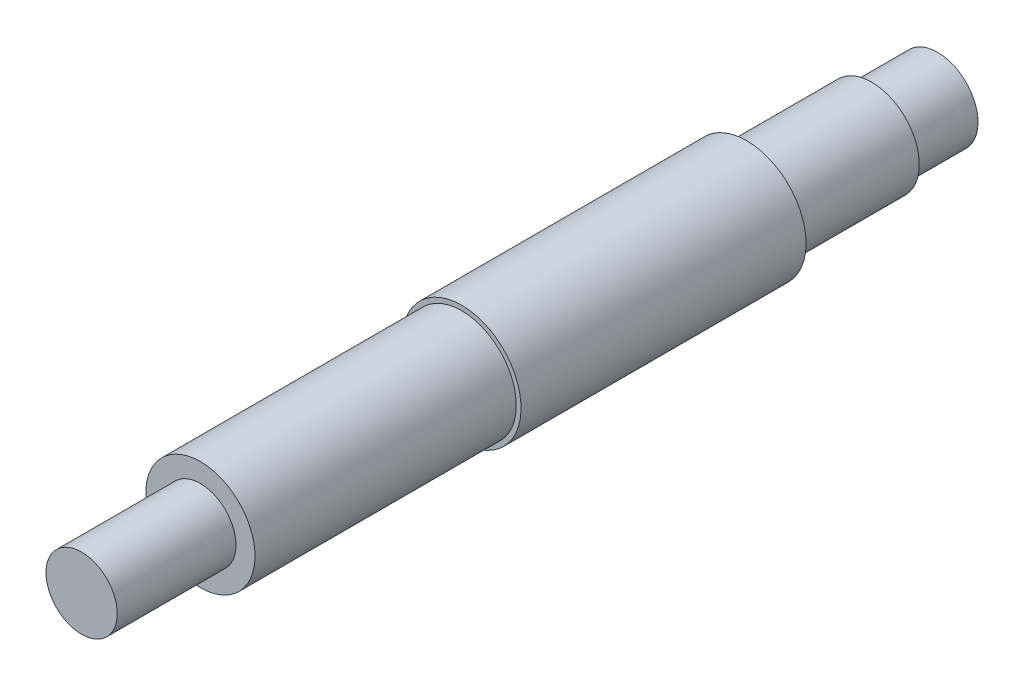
ISO-10303-21;
HEADER;
FILE_DESCRIPTION(('STEP AP214'),'2;1');
FILE_NAME('part.step','',(''),(''),'','','');
FILE_SCHEMA(('AUTOMOTIVE_DESIGN { 1 0 10303 214 1 1 1 1 }'));
ENDSEC;
DATA;
#1=APPLICATION_CONTEXT('core data for automotive mechanical design processes');
#2=APPLICATION_PROTOCOL_DEFINITION('international standard','automotive_design',2000,#1);
#3=PRODUCT_CONTEXT('',#1,'mechanical');
#4=PRODUCT('Part','Part','',(#3));
#5=PRODUCT_RELATED_PRODUCT_CATEGORY('part','',(#4));
#6=PRODUCT_DEFINITION_FORMATION('','',#4);
#7=PRODUCT_DEFINITION_CONTEXT('part definition',#1,'design');
#8=PRODUCT_DEFINITION('design','',#6,#7);
#9=PRODUCT_DEFINITION_SHAPE('','',#8);
#10=(LENGTH_UNIT() NAMED_UNIT(*) SI_UNIT(.MILLI.,.METRE.));
#11=(NAMED_UNIT(*) PLANE_ANGLE_UNIT() SI_UNIT($,.RADIAN.));
#12=(NAMED_UNIT(*) SI_UNIT($,.STERADIAN.) SOLID_ANGLE_UNIT());
#13=UNCERTAINTY_MEASURE_WITH_UNIT(LENGTH_MEASURE(1.E-05),#10,'distance_accuracy_value','');
#14=(GEOMETRIC_REPRESENTATION_CONTEXT(3) GLOBAL_UNCERTAINTY_ASSIGNED_CONTEXT((#13)) GLOBAL_UNIT_ASSIGNED_CONTEXT((#10,
#11,#12)) REPRESENTATION_CONTEXT('',''));
#15=CARTESIAN_POINT('',(0.,0.,0.));
#16=DIRECTION('',(0.,0.,1.));
#17=DIRECTION('',(1.,0.,0.));
#18=AXIS2_PLACEMENT_3D('',#15,#16,#17);
#19=CARTESIAN_POINT('',(-2.89720504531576E-12,706.541009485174,-206.692801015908));
#20=DIRECTION('',(0.,0.,1.));
#21=DIRECTION('',(0.,-1.,0.));
#22=AXIS2_PLACEMENT_3D('',#19,#20,#21);
#23=PLANE('',#22);
#24=CARTESIAN_POINT('',(-2.95011411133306E-12,706.541009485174,-206.692801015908));
#25=DIRECTION('',(0.,0.,1.));
#26=DIRECTION('',(0.,-1.,0.));
#27=AXIS2_PLACEMENT_3D('',#24,#25,#26);
#28=CIRCLE('',#27,15.);
#29=CARTESIAN_POINT('',(-2.95531828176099E-12,721.541009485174,-206.692801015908));
#30=VERTEX_POINT('',#29);
#31=EDGE_CURVE('E11',#30,#30,#28,.T.);
#32=ORIENTED_EDGE('',*,*,#31,.T.);
#33=EDGE_LOOP('',(#32));
#34=FACE_BOUND('',#33,.T.);
#35=ADVANCED_FACE('F17',(#34),#23,.T.);
#36=CARTESIAN_POINT('',(7.16223955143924E-13,676.541009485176,-539.342801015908));
#37=DIRECTION('',(0.,0.,1.));
#38=DIRECTION('',(0.,-1.,0.));
#39=AXIS2_PLACEMENT_3D('',#36,#37,#38);
#40=PLANE('',#39);
#41=CARTESIAN_POINT('',(7.11019784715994E-13,706.541009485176,-539.342801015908));
#42=DIRECTION('',(0.,0.,1.));
#43=DIRECTION('',(0.,-1.,0.));
#44=AXIS2_PLACEMENT_3D('',#41,#42,#43);
#45=CIRCLE('',#44,20.);
#46=CARTESIAN_POINT('',(6.3349932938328E-13,726.541009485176,-539.342801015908));
#47=VERTEX_POINT('',#46);
#48=EDGE_CURVE('E77',#47,#47,#45,.T.);
#49=ORIENTED_EDGE('',*,*,#48,.F.);
#50=EDGE_LOOP('',(#49));
#51=FACE_BOUND('',#50,.T.);
#52=CARTESIAN_POINT('',(7.11019784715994E-13,706.541009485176,-539.342801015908));
#53=DIRECTION('',(0.,0.,1.));
#54=DIRECTION('',(0.,-1.,0.));
#55=AXIS2_PLACEMENT_3D('',#52,#53,#54);
#56=CIRCLE('',#55,17.);
#57=CARTESIAN_POINT('',(6.67326437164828E-13,723.541009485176,-539.342801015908));
#58=VERTEX_POINT('',#57);
#59=EDGE_CURVE('E21',#58,#58,#56,.T.);
#60=ORIENTED_EDGE('',*,*,#59,.T.);
#61=EDGE_LOOP('',(#60));
#62=FACE_BOUND('',#61,.T.);
#63=ADVANCED_FACE('F118',(#51,#62),#40,.F.);
#64=CARTESIAN_POINT('',(0.,706.541009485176,-486.692801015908));
#65=DIRECTION('',(0.,0.,-1.));
#66=DIRECTION('',(0.,-1.,0.));
#67=AXIS2_PLACEMENT_3D('',#64,#65,#66);
#68=CYLINDRICAL_SURFACE('',#67,25.);
#69=CARTESIAN_POINT('',(-1.23187050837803E-12,706.541009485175,-366.692801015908));
#70=DIRECTION('',(0.,0.,1.));
#71=DIRECTION('',(0.,-1.,0.));
#72=AXIS2_PLACEMENT_3D('',#69,#70,#71);
#73=CIRCLE('',#72,25.);
#74=CARTESIAN_POINT('',(-1.21766745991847E-12,731.541009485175,-366.692801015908));
#75=VERTEX_POINT('',#74);
#76=EDGE_CURVE('E44',#75,#75,#73,.T.);
#77=ORIENTED_EDGE('',*,*,#76,.F.);
#78=EDGE_LOOP('',(#77));
#79=FACE_BOUND('',#78,.T.);
#80=CARTESIAN_POINT('',(0.,706.541009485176,-486.692801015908));
#81=DIRECTION('',(0.,0.,1.));
#82=DIRECTION('',(0.,-1.,0.));
#83=AXIS2_PLACEMENT_3D('',#80,#81,#82);
#84=CIRCLE('',#83,25.);
#85=CARTESIAN_POINT('',(0.,731.541009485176,-486.692801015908));
#86=VERTEX_POINT('',#85);
#87=EDGE_CURVE('E52',#86,#86,#84,.T.);
#88=ORIENTED_EDGE('',*,*,#87,.T.);
#89=EDGE_LOOP('',(#88));
#90=FACE_BOUND('',#89,.T.);
#91=ADVANCED_FACE('F123',(#79,#90),#68,.T.);
#92=CARTESIAN_POINT('',(0.,706.541009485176,-486.692801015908));
#93=DIRECTION('',(0.,0.,-1.));
#94=DIRECTION('',(0.,-1.,0.));
#95=AXIS2_PLACEMENT_3D('',#92,#93,#94);
#96=CYLINDRICAL_SURFACE('',#95,23.);
#97=CARTESIAN_POINT('',(-2.39760468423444E-12,706.541009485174,-256.692801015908));
#98=DIRECTION('',(0.,0.,1.));
#99=DIRECTION('',(0.,-1.,0.));
#100=AXIS2_PLACEMENT_3D('',#97,#98,#99);
#101=CIRCLE('',#100,23.);
#102=CARTESIAN_POINT('',(-2.39792994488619E-12,729.541009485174,-256.692801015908));
#103=VERTEX_POINT('',#102);
#104=EDGE_CURVE('E89',#103,#103,#101,.T.);
#105=ORIENTED_EDGE('',*,*,#104,.F.);
#106=EDGE_LOOP('',(#105));
#107=FACE_BOUND('',#106,.T.);
#108=CARTESIAN_POINT('',(-1.23187050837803E-12,706.541009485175,-366.692801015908));
#109=DIRECTION('',(0.,0.,1.));
#110=DIRECTION('',(0.,-1.,0.));
#111=AXIS2_PLACEMENT_3D('',#108,#109,#110);
#112=CIRCLE('',#111,23.);
#113=CARTESIAN_POINT('',(-1.23219576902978E-12,729.541009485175,-366.692801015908));
#114=VERTEX_POINT('',#113);
#115=EDGE_CURVE('E61',#114,#114,#112,.T.);
#116=ORIENTED_EDGE('',*,*,#115,.T.);
#117=EDGE_LOOP('',(#116));
#118=FACE_BOUND('',#117,.T.);
#119=ADVANCED_FACE('F128',(#107,#118),#96,.T.);
#120=CARTESIAN_POINT('',(-1.17115518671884E-12,676.541009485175,-366.692801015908));
#121=DIRECTION('',(0.,0.,1.));
#122=DIRECTION('',(0.,-1.,0.));
#123=AXIS2_PLACEMENT_3D('',#120,#121,#122);
#124=PLANE('',#123);
#125=ORIENTED_EDGE('',*,*,#115,.F.);
#126=EDGE_LOOP('',(#125));
#127=FACE_BOUND('',#126,.T.);
#128=ORIENTED_EDGE('',*,*,#76,.T.);
#129=EDGE_LOOP('',(#128));
#130=FACE_BOUND('',#129,.T.);
#131=ADVANCED_FACE('F19',(#127,#130),#124,.T.);
#132=CARTESIAN_POINT('',(0.,676.541009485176,-486.692801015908));
#133=DIRECTION('',(0.,0.,-1.));
#134=DIRECTION('',(0.,1.,0.));
#135=AXIS2_PLACEMENT_3D('',#132,#133,#134);
#136=PLANE('',#135);
#137=CARTESIAN_POINT('',(0.,706.541009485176,-486.692801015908));
#138=DIRECTION('',(0.,0.,-1.));
#139=DIRECTION('',(0.,-1.,0.));
#140=AXIS2_PLACEMENT_3D('',#137,#138,#139);
#141=CIRCLE('',#140,20.);
#142=CARTESIAN_POINT('',(0.,726.541009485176,-486.692801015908));
#143=VERTEX_POINT('',#142);
#144=EDGE_CURVE('E65',#143,#143,#141,.T.);
#145=ORIENTED_EDGE('',*,*,#144,.F.);
#146=EDGE_LOOP('',(#145));
#147=FACE_BOUND('',#146,.T.);
#148=ORIENTED_EDGE('',*,*,#87,.F.);
#149=EDGE_LOOP('',(#148));
#150=FACE_BOUND('',#149,.T.);
#151=ADVANCED_FACE('F112',(#147,#150),#136,.T.);
#152=CARTESIAN_POINT('',(-2.33688936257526E-12,676.541009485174,-256.692801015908));
#153=DIRECTION('',(0.,0.,-1.));
#154=DIRECTION('',(0.,1.,0.));
#155=AXIS2_PLACEMENT_3D('',#152,#153,#154);
#156=PLANE('',#155);
#157=ORIENTED_EDGE('',*,*,#104,.T.);
#158=EDGE_LOOP('',(#157));
#159=FACE_BOUND('',#158,.T.);
#160=CARTESIAN_POINT('',(-2.39760468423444E-12,706.541009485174,-256.692801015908));
#161=DIRECTION('',(0.,0.,1.));
#162=DIRECTION('',(0.,-1.,0.));
#163=AXIS2_PLACEMENT_3D('',#160,#161,#162);
#164=CIRCLE('',#163,15.);
#165=CARTESIAN_POINT('',(-2.40020676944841E-12,721.541009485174,-256.692801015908));
#166=VERTEX_POINT('',#165);
#167=EDGE_CURVE('E69',#166,#166,#164,.T.);
#168=ORIENTED_EDGE('',*,*,#167,.F.);
#169=EDGE_LOOP('',(#168));
#170=FACE_BOUND('',#169,.T.);
#171=ADVANCED_FACE('F103',(#159,#170),#156,.F.);
#172=CARTESIAN_POINT('',(0.,706.541009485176,-486.692801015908));
#173=DIRECTION('',(0.,0.,-1.));
#174=DIRECTION('',(0.,-1.,0.));
#175=AXIS2_PLACEMENT_3D('',#172,#173,#174);
#176=CYLINDRICAL_SURFACE('',#175,15.);
#177=ORIENTED_EDGE('',*,*,#31,.F.);
#178=EDGE_LOOP('',(#177));
#179=FACE_BOUND('',#178,.T.);
#180=ORIENTED_EDGE('',*,*,#167,.T.);
#181=EDGE_LOOP('',(#180));
#182=FACE_BOUND('',#181,.T.);
#183=ADVANCED_FACE('F100',(#179,#182),#176,.T.);
#184=CARTESIAN_POINT('',(0.,706.541009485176,-486.692801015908));
#185=DIRECTION('',(0.,0.,-1.));
#186=DIRECTION('',(0.,-1.,0.));
#187=AXIS2_PLACEMENT_3D('',#184,#185,#186);
#188=CYLINDRICAL_SURFACE('',#187,20.);
#189=ORIENTED_EDGE('',*,*,#144,.T.);
#190=EDGE_LOOP('',(#189));
#191=FACE_BOUND('',#190,.T.);
#192=ORIENTED_EDGE('',*,*,#48,.T.);
#193=EDGE_LOOP('',(#192));
#194=FACE_BOUND('',#193,.T.);
#195=ADVANCED_FACE('F102',(#191,#194),#188,.T.);
#196=CARTESIAN_POINT('',(-0.00766006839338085,706.085657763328,-567.092801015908));
#197=DIRECTION('',(0.,0.,1.));
#198=DIRECTION('',(0.,-1.,0.));
#199=AXIS2_PLACEMENT_3D('',#196,#197,#198);
#200=PLANE('',#199);
#201=CARTESIAN_POINT('',(8.77553238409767E-13,706.541009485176,-567.092801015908));
#202=DIRECTION('',(0.,0.,1.));
#203=DIRECTION('',(0.,-1.,0.));
#204=AXIS2_PLACEMENT_3D('',#201,#202,#203);
#205=CIRCLE('',#204,17.);
#206=CARTESIAN_POINT('',(8.33859890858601E-13,723.541009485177,-567.092801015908));
#207=VERTEX_POINT('',#206);
#208=EDGE_CURVE('E73',#207,#207,#205,.T.);
#209=ORIENTED_EDGE('',*,*,#208,.F.);
#210=EDGE_LOOP('',(#209));
#211=FACE_BOUND('',#210,.T.);
#212=ADVANCED_FACE('F74',(#211),#200,.F.);
#213=CARTESIAN_POINT('',(0.,706.541009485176,-486.692801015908));
#214=DIRECTION('',(0.,0.,-1.));
#215=DIRECTION('',(0.,-1.,0.));
#216=AXIS2_PLACEMENT_3D('',#213,#214,#215);
#217=CYLINDRICAL_SURFACE('',#216,17.);
#218=ORIENTED_EDGE('',*,*,#208,.T.);
#219=EDGE_LOOP('',(#218));
#220=FACE_BOUND('',#219,.T.);
#221=ORIENTED_EDGE('',*,*,#59,.F.);
#222=EDGE_LOOP('',(#221));
#223=FACE_BOUND('',#222,.T.);
#224=ADVANCED_FACE('F148',(#220,#223),#217,.T.);
#225=CLOSED_SHELL('',(#35,#63,#91,#119,#131,#151,#171,#183,#195,#212,#224));
#226=MANIFOLD_SOLID_BREP('B1',#225);
#227=ADVANCED_BREP_SHAPE_REPRESENTATION('',(#18,#226),#14);
#228=SHAPE_DEFINITION_REPRESENTATION(#9,#227);
ENDSEC;
END-ISO-10303-21;
